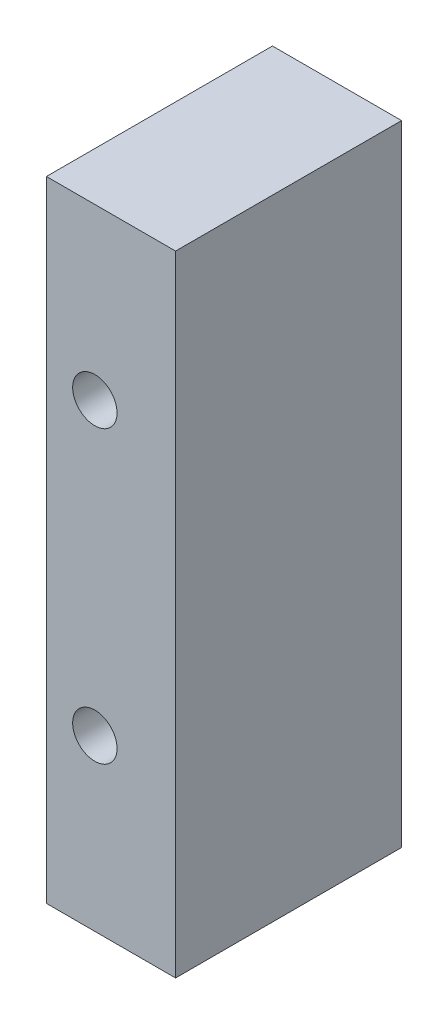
from build123d import *

# Parameters (mm, degrees)
ESQUISSE1_W             = 16
ESQUISSE1_H             = 78
EXTRUSION1_DEPTH        = 28
ESQUISSE2_R             = 2.75
ENL_V_MAT_EXTRU_1_DEPTH = 49.672374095


with BuildPart() as part:
    # Esquisse1 → Extrusion1 (new body)
    with BuildSketch(Plane.XY):
        Rectangle(ESQUISSE1_W, ESQUISSE1_H)
    extrude(amount=EXTRUSION1_DEPTH)

    # Esquisse2 → Enl_v. mat.-Extru.1 (cut, through all)
    with BuildSketch(Plane.XY.offset(28)):
        with Locations((-2, 18)):
            Circle(ESQUISSE2_R)
        with Locations((-2, -18)):
            Circle(ESQUISSE2_R)
    extrude(amount=-ENL_V_MAT_EXTRU_1_DEPTH, mode=Mode.SUBTRACT)


solid = part.part
